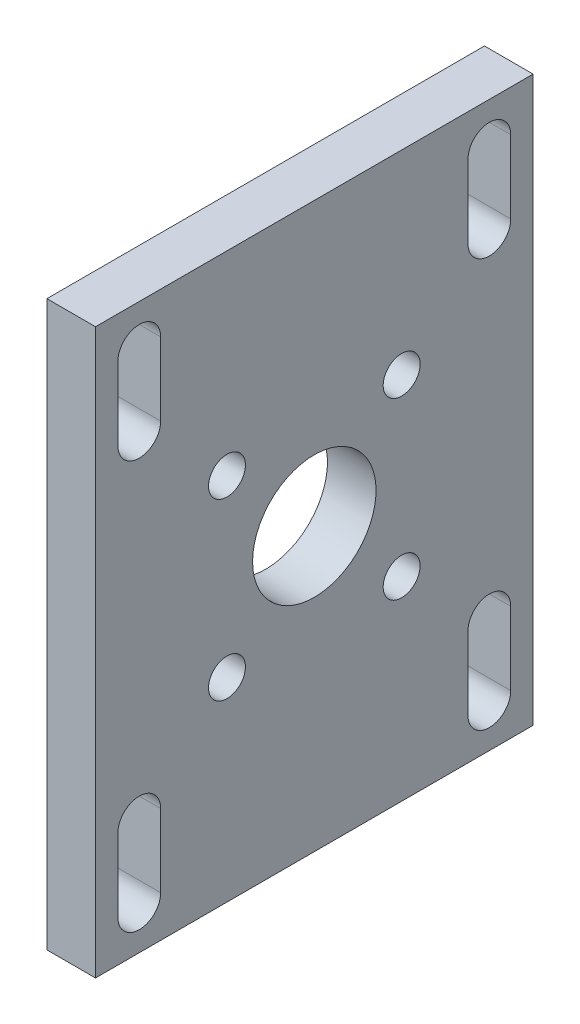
ISO-10303-21;
HEADER;
FILE_DESCRIPTION(('STEP AP214'),'2;1');
FILE_NAME('part.step','',(''),(''),'','','');
FILE_SCHEMA(('AUTOMOTIVE_DESIGN { 1 0 10303 214 1 1 1 1 }'));
ENDSEC;
DATA;
#1=APPLICATION_CONTEXT('core data for automotive mechanical design processes');
#2=APPLICATION_PROTOCOL_DEFINITION('international standard','automotive_design',2000,#1);
#3=PRODUCT_CONTEXT('',#1,'mechanical');
#4=PRODUCT('Part','Part','',(#3));
#5=PRODUCT_RELATED_PRODUCT_CATEGORY('part','',(#4));
#6=PRODUCT_DEFINITION_FORMATION('','',#4);
#7=PRODUCT_DEFINITION_CONTEXT('part definition',#1,'design');
#8=PRODUCT_DEFINITION('design','',#6,#7);
#9=PRODUCT_DEFINITION_SHAPE('','',#8);
#10=(LENGTH_UNIT() NAMED_UNIT(*) SI_UNIT(.MILLI.,.METRE.));
#11=(NAMED_UNIT(*) PLANE_ANGLE_UNIT() SI_UNIT($,.RADIAN.));
#12=(NAMED_UNIT(*) SI_UNIT($,.STERADIAN.) SOLID_ANGLE_UNIT());
#13=UNCERTAINTY_MEASURE_WITH_UNIT(LENGTH_MEASURE(1.E-05),#10,'distance_accuracy_value','');
#14=(GEOMETRIC_REPRESENTATION_CONTEXT(3) GLOBAL_UNCERTAINTY_ASSIGNED_CONTEXT((#13)) GLOBAL_UNIT_ASSIGNED_CONTEXT((#10,
#11,#12)) REPRESENTATION_CONTEXT('',''));
#15=CARTESIAN_POINT('',(0.,0.,0.));
#16=DIRECTION('',(0.,0.,1.));
#17=DIRECTION('',(1.,0.,0.));
#18=AXIS2_PLACEMENT_3D('',#15,#16,#17);
#19=CARTESIAN_POINT('',(5.,-29.,-22.5));
#20=DIRECTION('',(0.,0.,1.));
#21=DIRECTION('',(1.,0.,0.));
#22=AXIS2_PLACEMENT_3D('',#19,#20,#21);
#23=PLANE('',#22);
#24=DIRECTION('',(0.,1.,0.));
#25=VECTOR('',#24,1.);
#26=CARTESIAN_POINT('',(0.,-29.,-22.5));
#27=LINE('',#26,#25);
#28=CARTESIAN_POINT('',(0.,-29.,-22.5));
#29=VERTEX_POINT('',#28);
#30=CARTESIAN_POINT('',(0.,29.,-22.5));
#31=VERTEX_POINT('',#30);
#32=EDGE_CURVE('E298',#29,#31,#27,.T.);
#33=ORIENTED_EDGE('',*,*,#32,.T.);
#34=DIRECTION('',(-1.,0.,0.));
#35=VECTOR('',#34,1.);
#36=CARTESIAN_POINT('',(5.,29.,-22.5));
#37=LINE('',#36,#35);
#38=CARTESIAN_POINT('',(5.,29.,-22.5));
#39=VERTEX_POINT('',#38);
#40=EDGE_CURVE('E327',#39,#31,#37,.T.);
#41=ORIENTED_EDGE('',*,*,#40,.F.);
#42=DIRECTION('',(0.,1.,0.));
#43=VECTOR('',#42,1.);
#44=CARTESIAN_POINT('',(5.,-29.,-22.5));
#45=LINE('',#44,#43);
#46=CARTESIAN_POINT('',(5.,-29.,-22.5));
#47=VERTEX_POINT('',#46);
#48=EDGE_CURVE('E301',#47,#39,#45,.T.);
#49=ORIENTED_EDGE('',*,*,#48,.F.);
#50=DIRECTION('',(-1.,0.,0.));
#51=VECTOR('',#50,1.);
#52=CARTESIAN_POINT('',(5.,-29.,-22.5));
#53=LINE('',#52,#51);
#54=EDGE_CURVE('E311',#47,#29,#53,.T.);
#55=ORIENTED_EDGE('',*,*,#54,.T.);
#56=EDGE_LOOP('',(#33,#41,#49,#55));
#57=FACE_BOUND('',#56,.T.);
#58=ADVANCED_FACE('F46',(#57),#23,.F.);
#59=CARTESIAN_POINT('',(5.,29.,22.5));
#60=DIRECTION('',(0.,-1.,0.));
#61=DIRECTION('',(0.,0.,-1.));
#62=AXIS2_PLACEMENT_3D('',#59,#60,#61);
#63=PLANE('',#62);
#64=DIRECTION('',(0.,0.,1.));
#65=VECTOR('',#64,1.);
#66=CARTESIAN_POINT('',(0.,29.,22.5));
#67=LINE('',#66,#65);
#68=CARTESIAN_POINT('',(0.,29.,22.5));
#69=VERTEX_POINT('',#68);
#70=EDGE_CURVE('E314',#31,#69,#67,.T.);
#71=ORIENTED_EDGE('',*,*,#70,.T.);
#72=DIRECTION('',(-1.,0.,0.));
#73=VECTOR('',#72,1.);
#74=CARTESIAN_POINT('',(5.,29.,22.5));
#75=LINE('',#74,#73);
#76=CARTESIAN_POINT('',(5.,29.,22.5));
#77=VERTEX_POINT('',#76);
#78=EDGE_CURVE('E324',#77,#69,#75,.T.);
#79=ORIENTED_EDGE('',*,*,#78,.F.);
#80=DIRECTION('',(0.,0.,1.));
#81=VECTOR('',#80,1.);
#82=CARTESIAN_POINT('',(5.,29.,22.5));
#83=LINE('',#82,#81);
#84=EDGE_CURVE('E304',#39,#77,#83,.T.);
#85=ORIENTED_EDGE('',*,*,#84,.F.);
#86=ORIENTED_EDGE('',*,*,#40,.T.);
#87=EDGE_LOOP('',(#71,#79,#85,#86));
#88=FACE_BOUND('',#87,.T.);
#89=ADVANCED_FACE('F404',(#88),#63,.F.);
#90=CARTESIAN_POINT('',(5.,-29.,22.5));
#91=DIRECTION('',(0.,0.,-1.));
#92=DIRECTION('',(-1.,0.,0.));
#93=AXIS2_PLACEMENT_3D('',#90,#91,#92);
#94=PLANE('',#93);
#95=DIRECTION('',(0.,-1.,0.));
#96=VECTOR('',#95,1.);
#97=CARTESIAN_POINT('',(0.,-29.,22.5));
#98=LINE('',#97,#96);
#99=CARTESIAN_POINT('',(0.,-29.,22.5));
#100=VERTEX_POINT('',#99);
#101=EDGE_CURVE('E316',#69,#100,#98,.T.);
#102=ORIENTED_EDGE('',*,*,#101,.T.);
#103=DIRECTION('',(-1.,0.,0.));
#104=VECTOR('',#103,1.);
#105=CARTESIAN_POINT('',(5.,-29.,22.5));
#106=LINE('',#105,#104);
#107=CARTESIAN_POINT('',(5.,-29.,22.5));
#108=VERTEX_POINT('',#107);
#109=EDGE_CURVE('E321',#108,#100,#106,.T.);
#110=ORIENTED_EDGE('',*,*,#109,.F.);
#111=DIRECTION('',(0.,-1.,0.));
#112=VECTOR('',#111,1.);
#113=CARTESIAN_POINT('',(5.,-29.,22.5));
#114=LINE('',#113,#112);
#115=EDGE_CURVE('E307',#77,#108,#114,.T.);
#116=ORIENTED_EDGE('',*,*,#115,.F.);
#117=ORIENTED_EDGE('',*,*,#78,.T.);
#118=EDGE_LOOP('',(#102,#110,#116,#117));
#119=FACE_BOUND('',#118,.T.);
#120=ADVANCED_FACE('F410',(#119),#94,.F.);
#121=CARTESIAN_POINT('',(5.,-29.,22.5));
#122=DIRECTION('',(0.,1.,0.));
#123=DIRECTION('',(0.,0.,1.));
#124=AXIS2_PLACEMENT_3D('',#121,#122,#123);
#125=PLANE('',#124);
#126=DIRECTION('',(0.,0.,-1.));
#127=VECTOR('',#126,1.);
#128=CARTESIAN_POINT('',(0.,-29.,22.5));
#129=LINE('',#128,#127);
#130=EDGE_CURVE('E305',#100,#29,#129,.T.);
#131=ORIENTED_EDGE('',*,*,#130,.T.);
#132=ORIENTED_EDGE('',*,*,#54,.F.);
#133=DIRECTION('',(0.,0.,-1.));
#134=VECTOR('',#133,1.);
#135=CARTESIAN_POINT('',(5.,-29.,22.5));
#136=LINE('',#135,#134);
#137=EDGE_CURVE('E309',#108,#47,#136,.T.);
#138=ORIENTED_EDGE('',*,*,#137,.F.);
#139=ORIENTED_EDGE('',*,*,#109,.T.);
#140=EDGE_LOOP('',(#131,#132,#138,#139));
#141=FACE_BOUND('',#140,.T.);
#142=ADVANCED_FACE('F454',(#141),#125,.F.);
#143=CARTESIAN_POINT('',(5.,0.,0.));
#144=DIRECTION('',(-1.,0.,0.));
#145=DIRECTION('',(0.,0.,1.));
#146=AXIS2_PLACEMENT_3D('',#143,#144,#145);
#147=PLANE('',#146);
#148=DIRECTION('',(0.,-1.,0.));
#149=VECTOR('',#148,1.);
#150=CARTESIAN_POINT('',(5.,-24.75,15.8));
#151=LINE('',#150,#149);
#152=CARTESIAN_POINT('',(5.,-17.25,15.8));
#153=VERTEX_POINT('',#152);
#154=CARTESIAN_POINT('',(5.,-24.75,15.8));
#155=VERTEX_POINT('',#154);
#156=EDGE_CURVE('E218',#153,#155,#151,.T.);
#157=ORIENTED_EDGE('',*,*,#156,.T.);
#158=CARTESIAN_POINT('',(5.,-24.75,18.));
#159=DIRECTION('',(-1.,0.,0.));
#160=DIRECTION('',(0.,0.,1.));
#161=AXIS2_PLACEMENT_3D('',#158,#159,#160);
#162=CIRCLE('',#161,2.2);
#163=CARTESIAN_POINT('',(5.,-24.75,20.2));
#164=VERTEX_POINT('',#163);
#165=EDGE_CURVE('E223',#155,#164,#162,.T.);
#166=ORIENTED_EDGE('',*,*,#165,.T.);
#167=DIRECTION('',(0.,1.,0.));
#168=VECTOR('',#167,1.);
#169=CARTESIAN_POINT('',(5.,-24.75,20.2));
#170=LINE('',#169,#168);
#171=CARTESIAN_POINT('',(5.,-17.25,20.2));
#172=VERTEX_POINT('',#171);
#173=EDGE_CURVE('E195',#164,#172,#170,.T.);
#174=ORIENTED_EDGE('',*,*,#173,.T.);
#175=CARTESIAN_POINT('',(5.,-17.25,18.));
#176=DIRECTION('',(-1.,0.,0.));
#177=DIRECTION('',(0.,0.,1.));
#178=AXIS2_PLACEMENT_3D('',#175,#176,#177);
#179=CIRCLE('',#178,2.2);
#180=EDGE_CURVE('E202',#172,#153,#179,.T.);
#181=ORIENTED_EDGE('',*,*,#180,.T.);
#182=EDGE_LOOP('',(#157,#166,#174,#181));
#183=FACE_BOUND('',#182,.T.);
#184=DIRECTION('',(0.,-1.,0.));
#185=VECTOR('',#184,1.);
#186=CARTESIAN_POINT('',(5.,-24.75,-20.2));
#187=LINE('',#186,#185);
#188=CARTESIAN_POINT('',(5.,-17.25,-20.2));
#189=VERTEX_POINT('',#188);
#190=CARTESIAN_POINT('',(5.,-24.75,-20.2));
#191=VERTEX_POINT('',#190);
#192=EDGE_CURVE('E237',#189,#191,#187,.T.);
#193=ORIENTED_EDGE('',*,*,#192,.T.);
#194=CARTESIAN_POINT('',(5.,-24.75,-18.));
#195=DIRECTION('',(-1.,0.,0.));
#196=DIRECTION('',(0.,0.,1.));
#197=AXIS2_PLACEMENT_3D('',#194,#195,#196);
#198=CIRCLE('',#197,2.2);
#199=CARTESIAN_POINT('',(5.,-24.75,-15.8));
#200=VERTEX_POINT('',#199);
#201=EDGE_CURVE('E227',#191,#200,#198,.T.);
#202=ORIENTED_EDGE('',*,*,#201,.T.);
#203=DIRECTION('',(0.,1.,0.));
#204=VECTOR('',#203,1.);
#205=CARTESIAN_POINT('',(5.,-24.75,-15.8));
#206=LINE('',#205,#204);
#207=CARTESIAN_POINT('',(5.,-17.25,-15.8));
#208=VERTEX_POINT('',#207);
#209=EDGE_CURVE('E230',#200,#208,#206,.T.);
#210=ORIENTED_EDGE('',*,*,#209,.T.);
#211=CARTESIAN_POINT('',(5.,-17.25,-18.));
#212=DIRECTION('',(-1.,0.,0.));
#213=DIRECTION('',(0.,0.,1.));
#214=AXIS2_PLACEMENT_3D('',#211,#212,#213);
#215=CIRCLE('',#214,2.2);
#216=EDGE_CURVE('E234',#208,#189,#215,.T.);
#217=ORIENTED_EDGE('',*,*,#216,.T.);
#218=EDGE_LOOP('',(#193,#202,#210,#217));
#219=FACE_BOUND('',#218,.T.);
#220=CARTESIAN_POINT('',(5.,8.98025612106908,-8.98025612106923));
#221=DIRECTION('',(-1.,0.,0.));
#222=DIRECTION('',(0.,0.,1.));
#223=AXIS2_PLACEMENT_3D('',#220,#221,#222);
#224=CIRCLE('',#223,1.89865);
#225=CARTESIAN_POINT('',(5.,8.98025612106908,-7.08160612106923));
#226=VERTEX_POINT('',#225);
#227=EDGE_CURVE('E264',#226,#226,#224,.T.);
#228=ORIENTED_EDGE('',*,*,#227,.T.);
#229=EDGE_LOOP('',(#228));
#230=FACE_BOUND('',#229,.T.);
#231=CARTESIAN_POINT('',(5.,8.98025612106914,8.98025612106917));
#232=DIRECTION('',(-1.,0.,0.));
#233=DIRECTION('',(0.,0.,1.));
#234=AXIS2_PLACEMENT_3D('',#231,#232,#233);
#235=CIRCLE('',#234,1.89865);
#236=CARTESIAN_POINT('',(5.,8.98025612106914,10.8789061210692));
#237=VERTEX_POINT('',#236);
#238=EDGE_CURVE('E273',#237,#237,#235,.T.);
#239=ORIENTED_EDGE('',*,*,#238,.T.);
#240=EDGE_LOOP('',(#239));
#241=FACE_BOUND('',#240,.T.);
#242=CARTESIAN_POINT('',(5.,-8.98025612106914,8.98025612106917));
#243=DIRECTION('',(-1.,0.,0.));
#244=DIRECTION('',(0.,0.,1.));
#245=AXIS2_PLACEMENT_3D('',#242,#243,#244);
#246=CIRCLE('',#245,1.89865);
#247=CARTESIAN_POINT('',(5.,-8.98025612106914,10.8789061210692));
#248=VERTEX_POINT('',#247);
#249=EDGE_CURVE('E282',#248,#248,#246,.T.);
#250=ORIENTED_EDGE('',*,*,#249,.T.);
#251=EDGE_LOOP('',(#250));
#252=FACE_BOUND('',#251,.T.);
#253=CARTESIAN_POINT('',(5.,-8.98025612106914,-8.98025612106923));
#254=DIRECTION('',(-1.,0.,0.));
#255=DIRECTION('',(0.,0.,1.));
#256=AXIS2_PLACEMENT_3D('',#253,#254,#255);
#257=CIRCLE('',#256,1.89865);
#258=CARTESIAN_POINT('',(5.,-8.98025612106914,-7.08160612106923));
#259=VERTEX_POINT('',#258);
#260=EDGE_CURVE('E291',#259,#259,#257,.T.);
#261=ORIENTED_EDGE('',*,*,#260,.T.);
#262=EDGE_LOOP('',(#261));
#263=FACE_BOUND('',#262,.T.);
#264=CARTESIAN_POINT('',(5.,0.,0.));
#265=DIRECTION('',(-1.,0.,0.));
#266=DIRECTION('',(0.,0.,1.));
#267=AXIS2_PLACEMENT_3D('',#264,#265,#266);
#268=CIRCLE('',#267,6.35);
#269=CARTESIAN_POINT('',(5.,0.,6.35));
#270=VERTEX_POINT('',#269);
#271=EDGE_CURVE('E295',#270,#270,#268,.T.);
#272=ORIENTED_EDGE('',*,*,#271,.T.);
#273=EDGE_LOOP('',(#272));
#274=FACE_BOUND('',#273,.T.);
#275=ORIENTED_EDGE('',*,*,#48,.T.);
#276=ORIENTED_EDGE('',*,*,#84,.T.);
#277=ORIENTED_EDGE('',*,*,#115,.T.);
#278=ORIENTED_EDGE('',*,*,#137,.T.);
#279=EDGE_LOOP('',(#275,#276,#277,#278));
#280=FACE_BOUND('',#279,.T.);
#281=CARTESIAN_POINT('',(5.,17.25,-18.));
#282=DIRECTION('',(-1.,0.,0.));
#283=DIRECTION('',(0.,0.,1.));
#284=AXIS2_PLACEMENT_3D('',#281,#282,#283);
#285=CIRCLE('',#284,2.2);
#286=CARTESIAN_POINT('',(5.,17.25,-20.2));
#287=VERTEX_POINT('',#286);
#288=CARTESIAN_POINT('',(5.,17.25,-15.8));
#289=VERTEX_POINT('',#288);
#290=EDGE_CURVE('E341',#287,#289,#285,.T.);
#291=ORIENTED_EDGE('',*,*,#290,.T.);
#292=DIRECTION('',(0.,1.,0.));
#293=VECTOR('',#292,1.);
#294=CARTESIAN_POINT('',(5.,17.25,-15.8));
#295=LINE('',#294,#293);
#296=CARTESIAN_POINT('',(5.,24.75,-15.8));
#297=VERTEX_POINT('',#296);
#298=EDGE_CURVE('E343',#289,#297,#295,.T.);
#299=ORIENTED_EDGE('',*,*,#298,.T.);
#300=CARTESIAN_POINT('',(5.,24.75,-18.));
#301=DIRECTION('',(-1.,0.,0.));
#302=DIRECTION('',(0.,0.,1.));
#303=AXIS2_PLACEMENT_3D('',#300,#301,#302);
#304=CIRCLE('',#303,2.2);
#305=CARTESIAN_POINT('',(5.,24.75,-20.2));
#306=VERTEX_POINT('',#305);
#307=EDGE_CURVE('E345',#297,#306,#304,.T.);
#308=ORIENTED_EDGE('',*,*,#307,.T.);
#309=DIRECTION('',(0.,-1.,0.));
#310=VECTOR('',#309,1.);
#311=CARTESIAN_POINT('',(5.,17.25,-20.2));
#312=LINE('',#311,#310);
#313=EDGE_CURVE('E347',#306,#287,#312,.T.);
#314=ORIENTED_EDGE('',*,*,#313,.T.);
#315=EDGE_LOOP('',(#291,#299,#308,#314));
#316=FACE_BOUND('',#315,.T.);
#317=CARTESIAN_POINT('',(5.,17.25,18.));
#318=DIRECTION('',(-1.,0.,0.));
#319=DIRECTION('',(0.,0.,1.));
#320=AXIS2_PLACEMENT_3D('',#317,#318,#319);
#321=CIRCLE('',#320,2.2);
#322=CARTESIAN_POINT('',(5.,17.25,15.8));
#323=VERTEX_POINT('',#322);
#324=CARTESIAN_POINT('',(5.,17.25,20.2));
#325=VERTEX_POINT('',#324);
#326=EDGE_CURVE('E61',#323,#325,#321,.T.);
#327=ORIENTED_EDGE('',*,*,#326,.T.);
#328=DIRECTION('',(0.,1.,0.));
#329=VECTOR('',#328,1.);
#330=CARTESIAN_POINT('',(5.,17.25,20.2));
#331=LINE('',#330,#329);
#332=CARTESIAN_POINT('',(5.,24.75,20.2));
#333=VERTEX_POINT('',#332);
#334=EDGE_CURVE('E374',#325,#333,#331,.T.);
#335=ORIENTED_EDGE('',*,*,#334,.T.);
#336=CARTESIAN_POINT('',(5.,24.75,18.));
#337=DIRECTION('',(-1.,0.,0.));
#338=DIRECTION('',(0.,0.,1.));
#339=AXIS2_PLACEMENT_3D('',#336,#337,#338);
#340=CIRCLE('',#339,2.2);
#341=CARTESIAN_POINT('',(5.,24.75,15.8));
#342=VERTEX_POINT('',#341);
#343=EDGE_CURVE('E68',#333,#342,#340,.T.);
#344=ORIENTED_EDGE('',*,*,#343,.T.);
#345=DIRECTION('',(0.,-1.,0.));
#346=VECTOR('',#345,1.);
#347=CARTESIAN_POINT('',(5.,17.25,15.8));
#348=LINE('',#347,#346);
#349=EDGE_CURVE('E377',#342,#323,#348,.T.);
#350=ORIENTED_EDGE('',*,*,#349,.T.);
#351=EDGE_LOOP('',(#327,#335,#344,#350));
#352=FACE_BOUND('',#351,.T.);
#353=ADVANCED_FACE('F442',(#183,#219,#230,#241,#252,#263,#274,#280,#316,#352),#147,.F.);
#354=CARTESIAN_POINT('',(0.,0.,0.));
#355=DIRECTION('',(-1.,0.,0.));
#356=DIRECTION('',(0.,0.,1.));
#357=AXIS2_PLACEMENT_3D('',#354,#355,#356);
#358=PLANE('',#357);
#359=CARTESIAN_POINT('',(0.,-24.75,18.));
#360=DIRECTION('',(-1.,0.,0.));
#361=DIRECTION('',(0.,0.,1.));
#362=AXIS2_PLACEMENT_3D('',#359,#360,#361);
#363=CIRCLE('',#362,2.2);
#364=CARTESIAN_POINT('',(0.,-24.75,15.8));
#365=VERTEX_POINT('',#364);
#366=CARTESIAN_POINT('',(0.,-24.75,20.2));
#367=VERTEX_POINT('',#366);
#368=EDGE_CURVE('E221',#365,#367,#363,.T.);
#369=ORIENTED_EDGE('',*,*,#368,.F.);
#370=DIRECTION('',(0.,-1.,0.));
#371=VECTOR('',#370,1.);
#372=CARTESIAN_POINT('',(0.,-24.75,15.8));
#373=LINE('',#372,#371);
#374=CARTESIAN_POINT('',(0.,-17.25,15.8));
#375=VERTEX_POINT('',#374);
#376=EDGE_CURVE('E207',#375,#365,#373,.T.);
#377=ORIENTED_EDGE('',*,*,#376,.F.);
#378=CARTESIAN_POINT('',(0.,-17.25,18.));
#379=DIRECTION('',(-1.,0.,0.));
#380=DIRECTION('',(0.,0.,1.));
#381=AXIS2_PLACEMENT_3D('',#378,#379,#380);
#382=CIRCLE('',#381,2.2);
#383=CARTESIAN_POINT('',(0.,-17.25,20.2));
#384=VERTEX_POINT('',#383);
#385=EDGE_CURVE('E199',#384,#375,#382,.T.);
#386=ORIENTED_EDGE('',*,*,#385,.F.);
#387=DIRECTION('',(0.,1.,0.));
#388=VECTOR('',#387,1.);
#389=CARTESIAN_POINT('',(0.,-24.75,20.2));
#390=LINE('',#389,#388);
#391=EDGE_CURVE('E185',#367,#384,#390,.T.);
#392=ORIENTED_EDGE('',*,*,#391,.F.);
#393=EDGE_LOOP('',(#369,#377,#386,#392));
#394=FACE_BOUND('',#393,.T.);
#395=CARTESIAN_POINT('',(0.,-24.75,-18.));
#396=DIRECTION('',(-1.,0.,0.));
#397=DIRECTION('',(0.,0.,1.));
#398=AXIS2_PLACEMENT_3D('',#395,#396,#397);
#399=CIRCLE('',#398,2.2);
#400=CARTESIAN_POINT('',(0.,-24.75,-20.2));
#401=VERTEX_POINT('',#400);
#402=CARTESIAN_POINT('',(0.,-24.75,-15.8));
#403=VERTEX_POINT('',#402);
#404=EDGE_CURVE('E226',#401,#403,#399,.T.);
#405=ORIENTED_EDGE('',*,*,#404,.F.);
#406=DIRECTION('',(0.,-1.,0.));
#407=VECTOR('',#406,1.);
#408=CARTESIAN_POINT('',(0.,-24.75,-20.2));
#409=LINE('',#408,#407);
#410=CARTESIAN_POINT('',(0.,-17.25,-20.2));
#411=VERTEX_POINT('',#410);
#412=EDGE_CURVE('E231',#411,#401,#409,.T.);
#413=ORIENTED_EDGE('',*,*,#412,.F.);
#414=CARTESIAN_POINT('',(0.,-17.25,-18.));
#415=DIRECTION('',(-1.,0.,0.));
#416=DIRECTION('',(0.,0.,1.));
#417=AXIS2_PLACEMENT_3D('',#414,#415,#416);
#418=CIRCLE('',#417,2.2);
#419=CARTESIAN_POINT('',(0.,-17.25,-15.8));
#420=VERTEX_POINT('',#419);
#421=EDGE_CURVE('E245',#420,#411,#418,.T.);
#422=ORIENTED_EDGE('',*,*,#421,.F.);
#423=DIRECTION('',(0.,1.,0.));
#424=VECTOR('',#423,1.);
#425=CARTESIAN_POINT('',(0.,-24.75,-15.8));
#426=LINE('',#425,#424);
#427=EDGE_CURVE('E242',#403,#420,#426,.T.);
#428=ORIENTED_EDGE('',*,*,#427,.F.);
#429=EDGE_LOOP('',(#405,#413,#422,#428));
#430=FACE_BOUND('',#429,.T.);
#431=CARTESIAN_POINT('',(0.,8.98025612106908,-8.98025612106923));
#432=DIRECTION('',(-1.,0.,0.));
#433=DIRECTION('',(0.,0.,1.));
#434=AXIS2_PLACEMENT_3D('',#431,#432,#433);
#435=CIRCLE('',#434,3.5433);
#436=CARTESIAN_POINT('',(0.,8.98025612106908,-5.43695612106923));
#437=VERTEX_POINT('',#436);
#438=EDGE_CURVE('E252',#437,#437,#435,.T.);
#439=ORIENTED_EDGE('',*,*,#438,.F.);
#440=EDGE_LOOP('',(#439));
#441=FACE_BOUND('',#440,.T.);
#442=CARTESIAN_POINT('',(0.,8.98025612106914,8.98025612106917));
#443=DIRECTION('',(-1.,0.,0.));
#444=DIRECTION('',(0.,0.,1.));
#445=AXIS2_PLACEMENT_3D('',#442,#443,#444);
#446=CIRCLE('',#445,3.5433);
#447=CARTESIAN_POINT('',(0.,8.98025612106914,12.5235561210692));
#448=VERTEX_POINT('',#447);
#449=EDGE_CURVE('E267',#448,#448,#446,.T.);
#450=ORIENTED_EDGE('',*,*,#449,.F.);
#451=EDGE_LOOP('',(#450));
#452=FACE_BOUND('',#451,.T.);
#453=CARTESIAN_POINT('',(0.,-8.98025612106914,8.98025612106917));
#454=DIRECTION('',(-1.,0.,0.));
#455=DIRECTION('',(0.,0.,1.));
#456=AXIS2_PLACEMENT_3D('',#453,#454,#455);
#457=CIRCLE('',#456,3.5433);
#458=CARTESIAN_POINT('',(0.,-8.98025612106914,12.5235561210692));
#459=VERTEX_POINT('',#458);
#460=EDGE_CURVE('E276',#459,#459,#457,.T.);
#461=ORIENTED_EDGE('',*,*,#460,.F.);
#462=EDGE_LOOP('',(#461));
#463=FACE_BOUND('',#462,.T.);
#464=CARTESIAN_POINT('',(0.,-8.98025612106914,-8.98025612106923));
#465=DIRECTION('',(-1.,0.,0.));
#466=DIRECTION('',(0.,0.,1.));
#467=AXIS2_PLACEMENT_3D('',#464,#465,#466);
#468=CIRCLE('',#467,3.5433);
#469=CARTESIAN_POINT('',(0.,-8.98025612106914,-5.43695612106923));
#470=VERTEX_POINT('',#469);
#471=EDGE_CURVE('E285',#470,#470,#468,.T.);
#472=ORIENTED_EDGE('',*,*,#471,.F.);
#473=EDGE_LOOP('',(#472));
#474=FACE_BOUND('',#473,.T.);
#475=CARTESIAN_POINT('',(0.,0.,0.));
#476=DIRECTION('',(-1.,0.,0.));
#477=DIRECTION('',(0.,0.,1.));
#478=AXIS2_PLACEMENT_3D('',#475,#476,#477);
#479=CIRCLE('',#478,6.35);
#480=CARTESIAN_POINT('',(0.,0.,6.35));
#481=VERTEX_POINT('',#480);
#482=EDGE_CURVE('E294',#481,#481,#479,.T.);
#483=ORIENTED_EDGE('',*,*,#482,.F.);
#484=EDGE_LOOP('',(#483));
#485=FACE_BOUND('',#484,.T.);
#486=ORIENTED_EDGE('',*,*,#32,.F.);
#487=ORIENTED_EDGE('',*,*,#130,.F.);
#488=ORIENTED_EDGE('',*,*,#101,.F.);
#489=ORIENTED_EDGE('',*,*,#70,.F.);
#490=EDGE_LOOP('',(#486,#487,#488,#489));
#491=FACE_BOUND('',#490,.T.);
#492=CARTESIAN_POINT('',(0.,17.25,-18.));
#493=DIRECTION('',(-1.,0.,0.));
#494=DIRECTION('',(0.,0.,1.));
#495=AXIS2_PLACEMENT_3D('',#492,#493,#494);
#496=CIRCLE('',#495,2.2);
#497=CARTESIAN_POINT('',(0.,17.25,-20.2));
#498=VERTEX_POINT('',#497);
#499=CARTESIAN_POINT('',(0.,17.25,-15.8));
#500=VERTEX_POINT('',#499);
#501=EDGE_CURVE('E330',#498,#500,#496,.T.);
#502=ORIENTED_EDGE('',*,*,#501,.F.);
#503=DIRECTION('',(0.,-1.,0.));
#504=VECTOR('',#503,1.);
#505=CARTESIAN_POINT('',(0.,17.25,-20.2));
#506=LINE('',#505,#504);
#507=CARTESIAN_POINT('',(0.,24.75,-20.2));
#508=VERTEX_POINT('',#507);
#509=EDGE_CURVE('E332',#508,#498,#506,.T.);
#510=ORIENTED_EDGE('',*,*,#509,.F.);
#511=CARTESIAN_POINT('',(0.,24.75,-18.));
#512=DIRECTION('',(-1.,0.,0.));
#513=DIRECTION('',(0.,0.,1.));
#514=AXIS2_PLACEMENT_3D('',#511,#512,#513);
#515=CIRCLE('',#514,2.2);
#516=CARTESIAN_POINT('',(0.,24.75,-15.8));
#517=VERTEX_POINT('',#516);
#518=EDGE_CURVE('E335',#517,#508,#515,.T.);
#519=ORIENTED_EDGE('',*,*,#518,.F.);
#520=DIRECTION('',(0.,1.,0.));
#521=VECTOR('',#520,1.);
#522=CARTESIAN_POINT('',(0.,17.25,-15.8));
#523=LINE('',#522,#521);
#524=EDGE_CURVE('E338',#500,#517,#523,.T.);
#525=ORIENTED_EDGE('',*,*,#524,.F.);
#526=EDGE_LOOP('',(#502,#510,#519,#525));
#527=FACE_BOUND('',#526,.T.);
#528=CARTESIAN_POINT('',(0.,17.25,18.));
#529=DIRECTION('',(-1.,0.,0.));
#530=DIRECTION('',(0.,0.,1.));
#531=AXIS2_PLACEMENT_3D('',#528,#529,#530);
#532=CIRCLE('',#531,2.2);
#533=CARTESIAN_POINT('',(0.,17.25,15.8));
#534=VERTEX_POINT('',#533);
#535=CARTESIAN_POINT('',(0.,17.25,20.2));
#536=VERTEX_POINT('',#535);
#537=EDGE_CURVE('E362',#534,#536,#532,.T.);
#538=ORIENTED_EDGE('',*,*,#537,.F.);
#539=DIRECTION('',(0.,-1.,0.));
#540=VECTOR('',#539,1.);
#541=CARTESIAN_POINT('',(0.,17.25,15.8));
#542=LINE('',#541,#540);
#543=CARTESIAN_POINT('',(0.,24.75,15.8));
#544=VERTEX_POINT('',#543);
#545=EDGE_CURVE('E364',#544,#534,#542,.T.);
#546=ORIENTED_EDGE('',*,*,#545,.F.);
#547=CARTESIAN_POINT('',(0.,24.75,18.));
#548=DIRECTION('',(-1.,0.,0.));
#549=DIRECTION('',(0.,0.,1.));
#550=AXIS2_PLACEMENT_3D('',#547,#548,#549);
#551=CIRCLE('',#550,2.2);
#552=CARTESIAN_POINT('',(0.,24.75,20.2));
#553=VERTEX_POINT('',#552);
#554=EDGE_CURVE('E367',#553,#544,#551,.T.);
#555=ORIENTED_EDGE('',*,*,#554,.F.);
#556=DIRECTION('',(0.,1.,0.));
#557=VECTOR('',#556,1.);
#558=CARTESIAN_POINT('',(0.,17.25,20.2));
#559=LINE('',#558,#557);
#560=EDGE_CURVE('E370',#536,#553,#559,.T.);
#561=ORIENTED_EDGE('',*,*,#560,.F.);
#562=EDGE_LOOP('',(#538,#546,#555,#561));
#563=FACE_BOUND('',#562,.T.);
#564=ADVANCED_FACE('F205',(#394,#430,#441,#452,#463,#474,#485,#491,#527,#563),#358,.T.);
#565=CARTESIAN_POINT('',(5.,0.,0.));
#566=DIRECTION('',(-1.,0.,0.));
#567=DIRECTION('',(0.,0.,1.));
#568=AXIS2_PLACEMENT_3D('',#565,#566,#567);
#569=CYLINDRICAL_SURFACE('',#568,6.35);
#570=ORIENTED_EDGE('',*,*,#271,.F.);
#571=EDGE_LOOP('',(#570));
#572=FACE_BOUND('',#571,.T.);
#573=ORIENTED_EDGE('',*,*,#482,.T.);
#574=EDGE_LOOP('',(#573));
#575=FACE_BOUND('',#574,.T.);
#576=ADVANCED_FACE('F445',(#572,#575),#569,.F.);
#577=CARTESIAN_POINT('',(0.,-8.98025612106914,-8.98025612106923));
#578=DIRECTION('',(-1.,0.,0.));
#579=DIRECTION('',(0.,0.,1.));
#580=AXIS2_PLACEMENT_3D('',#577,#578,#579);
#581=CYLINDRICAL_SURFACE('',#580,1.89865);
#582=ORIENTED_EDGE('',*,*,#260,.F.);
#583=EDGE_LOOP('',(#582));
#584=FACE_BOUND('',#583,.T.);
#585=CARTESIAN_POINT('',(1.89195340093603,-8.98025612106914,-8.98025612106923));
#586=DIRECTION('',(-1.,0.,0.));
#587=DIRECTION('',(0.,0.,1.));
#588=AXIS2_PLACEMENT_3D('',#585,#586,#587);
#589=CIRCLE('',#588,1.89865);
#590=CARTESIAN_POINT('',(1.89195340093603,-8.98025612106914,-7.08160612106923));
#591=VERTEX_POINT('',#590);
#592=EDGE_CURVE('E288',#591,#591,#589,.T.);
#593=ORIENTED_EDGE('',*,*,#592,.T.);
#594=EDGE_LOOP('',(#593));
#595=FACE_BOUND('',#594,.T.);
#596=ADVANCED_FACE('F451',(#584,#595),#581,.F.);
#597=CARTESIAN_POINT('',(0.,-8.98025612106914,-8.98025612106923));
#598=DIRECTION('',(-1.,0.,0.));
#599=DIRECTION('',(0.,0.,1.));
#600=AXIS2_PLACEMENT_3D('',#597,#598,#599);
#601=CONICAL_SURFACE('',#600,3.5433,0.715584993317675);
#602=ORIENTED_EDGE('',*,*,#592,.F.);
#603=EDGE_LOOP('',(#602));
#604=FACE_BOUND('',#603,.T.);
#605=ORIENTED_EDGE('',*,*,#471,.T.);
#606=EDGE_LOOP('',(#605));
#607=FACE_BOUND('',#606,.T.);
#608=ADVANCED_FACE('F620',(#604,#607),#601,.F.);
#609=CARTESIAN_POINT('',(0.,-8.98025612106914,8.98025612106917));
#610=DIRECTION('',(-1.,0.,0.));
#611=DIRECTION('',(0.,0.,1.));
#612=AXIS2_PLACEMENT_3D('',#609,#610,#611);
#613=CYLINDRICAL_SURFACE('',#612,1.89865);
#614=ORIENTED_EDGE('',*,*,#249,.F.);
#615=EDGE_LOOP('',(#614));
#616=FACE_BOUND('',#615,.T.);
#617=CARTESIAN_POINT('',(1.89195340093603,-8.98025612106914,8.98025612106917));
#618=DIRECTION('',(-1.,0.,0.));
#619=DIRECTION('',(0.,0.,1.));
#620=AXIS2_PLACEMENT_3D('',#617,#618,#619);
#621=CIRCLE('',#620,1.89865);
#622=CARTESIAN_POINT('',(1.89195340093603,-8.98025612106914,10.8789061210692));
#623=VERTEX_POINT('',#622);
#624=EDGE_CURVE('E279',#623,#623,#621,.T.);
#625=ORIENTED_EDGE('',*,*,#624,.T.);
#626=EDGE_LOOP('',(#625));
#627=FACE_BOUND('',#626,.T.);
#628=ADVANCED_FACE('F616',(#616,#627),#613,.F.);
#629=CARTESIAN_POINT('',(0.,-8.98025612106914,8.98025612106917));
#630=DIRECTION('',(-1.,0.,0.));
#631=DIRECTION('',(0.,0.,1.));
#632=AXIS2_PLACEMENT_3D('',#629,#630,#631);
#633=CONICAL_SURFACE('',#632,3.5433,0.715584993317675);
#634=ORIENTED_EDGE('',*,*,#624,.F.);
#635=EDGE_LOOP('',(#634));
#636=FACE_BOUND('',#635,.T.);
#637=ORIENTED_EDGE('',*,*,#460,.T.);
#638=EDGE_LOOP('',(#637));
#639=FACE_BOUND('',#638,.T.);
#640=ADVANCED_FACE('F612',(#636,#639),#633,.F.);
#641=CARTESIAN_POINT('',(0.,8.98025612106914,8.98025612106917));
#642=DIRECTION('',(-1.,0.,0.));
#643=DIRECTION('',(0.,0.,1.));
#644=AXIS2_PLACEMENT_3D('',#641,#642,#643);
#645=CYLINDRICAL_SURFACE('',#644,1.89865);
#646=ORIENTED_EDGE('',*,*,#238,.F.);
#647=EDGE_LOOP('',(#646));
#648=FACE_BOUND('',#647,.T.);
#649=CARTESIAN_POINT('',(1.89195340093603,8.98025612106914,8.98025612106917));
#650=DIRECTION('',(-1.,0.,0.));
#651=DIRECTION('',(0.,0.,1.));
#652=AXIS2_PLACEMENT_3D('',#649,#650,#651);
#653=CIRCLE('',#652,1.89865);
#654=CARTESIAN_POINT('',(1.89195340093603,8.98025612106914,10.8789061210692));
#655=VERTEX_POINT('',#654);
#656=EDGE_CURVE('E270',#655,#655,#653,.T.);
#657=ORIENTED_EDGE('',*,*,#656,.T.);
#658=EDGE_LOOP('',(#657));
#659=FACE_BOUND('',#658,.T.);
#660=ADVANCED_FACE('F608',(#648,#659),#645,.F.);
#661=CARTESIAN_POINT('',(0.,8.98025612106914,8.98025612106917));
#662=DIRECTION('',(-1.,0.,0.));
#663=DIRECTION('',(0.,0.,1.));
#664=AXIS2_PLACEMENT_3D('',#661,#662,#663);
#665=CONICAL_SURFACE('',#664,3.5433,0.715584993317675);
#666=ORIENTED_EDGE('',*,*,#656,.F.);
#667=EDGE_LOOP('',(#666));
#668=FACE_BOUND('',#667,.T.);
#669=ORIENTED_EDGE('',*,*,#449,.T.);
#670=EDGE_LOOP('',(#669));
#671=FACE_BOUND('',#670,.T.);
#672=ADVANCED_FACE('F604',(#668,#671),#665,.F.);
#673=CARTESIAN_POINT('',(0.,8.98025612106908,-8.98025612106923));
#674=DIRECTION('',(-1.,0.,0.));
#675=DIRECTION('',(0.,0.,1.));
#676=AXIS2_PLACEMENT_3D('',#673,#674,#675);
#677=CYLINDRICAL_SURFACE('',#676,1.89865);
#678=ORIENTED_EDGE('',*,*,#227,.F.);
#679=EDGE_LOOP('',(#678));
#680=FACE_BOUND('',#679,.T.);
#681=CARTESIAN_POINT('',(1.89195340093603,8.98025612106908,-8.98025612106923));
#682=DIRECTION('',(-1.,0.,0.));
#683=DIRECTION('',(0.,0.,1.));
#684=AXIS2_PLACEMENT_3D('',#681,#682,#683);
#685=CIRCLE('',#684,1.89865);
#686=CARTESIAN_POINT('',(1.89195340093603,8.98025612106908,-7.08160612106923));
#687=VERTEX_POINT('',#686);
#688=EDGE_CURVE('E261',#687,#687,#685,.T.);
#689=ORIENTED_EDGE('',*,*,#688,.T.);
#690=EDGE_LOOP('',(#689));
#691=FACE_BOUND('',#690,.T.);
#692=ADVANCED_FACE('F600',(#680,#691),#677,.F.);
#693=CARTESIAN_POINT('',(0.,8.98025612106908,-8.98025612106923));
#694=DIRECTION('',(-1.,0.,0.));
#695=DIRECTION('',(0.,0.,1.));
#696=AXIS2_PLACEMENT_3D('',#693,#694,#695);
#697=CONICAL_SURFACE('',#696,3.5433,0.715584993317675);
#698=ORIENTED_EDGE('',*,*,#688,.F.);
#699=EDGE_LOOP('',(#698));
#700=FACE_BOUND('',#699,.T.);
#701=ORIENTED_EDGE('',*,*,#438,.T.);
#702=EDGE_LOOP('',(#701));
#703=FACE_BOUND('',#702,.T.);
#704=ADVANCED_FACE('F596',(#700,#703),#697,.F.);
#705=CARTESIAN_POINT('',(5.,-24.75,-18.));
#706=DIRECTION('',(-1.,0.,0.));
#707=DIRECTION('',(0.,0.,1.));
#708=AXIS2_PLACEMENT_3D('',#705,#706,#707);
#709=CYLINDRICAL_SURFACE('',#708,2.2);
#710=ORIENTED_EDGE('',*,*,#404,.T.);
#711=DIRECTION('',(-1.,0.,0.));
#712=VECTOR('',#711,1.);
#713=CARTESIAN_POINT('',(5.,-24.75,-15.8));
#714=LINE('',#713,#712);
#715=EDGE_CURVE('E240',#200,#403,#714,.T.);
#716=ORIENTED_EDGE('',*,*,#715,.F.);
#717=ORIENTED_EDGE('',*,*,#201,.F.);
#718=DIRECTION('',(-1.,0.,0.));
#719=VECTOR('',#718,1.);
#720=CARTESIAN_POINT('',(5.,-24.75,-20.2));
#721=LINE('',#720,#719);
#722=EDGE_CURVE('E250',#191,#401,#721,.T.);
#723=ORIENTED_EDGE('',*,*,#722,.T.);
#724=EDGE_LOOP('',(#710,#716,#717,#723));
#725=FACE_BOUND('',#724,.T.);
#726=ADVANCED_FACE('F587',(#725),#709,.F.);
#727=CARTESIAN_POINT('',(5.,-24.75,-20.2));
#728=DIRECTION('',(0.,0.,-1.));
#729=DIRECTION('',(-1.,0.,0.));
#730=AXIS2_PLACEMENT_3D('',#727,#728,#729);
#731=PLANE('',#730);
#732=ORIENTED_EDGE('',*,*,#412,.T.);
#733=ORIENTED_EDGE('',*,*,#722,.F.);
#734=ORIENTED_EDGE('',*,*,#192,.F.);
#735=DIRECTION('',(-1.,0.,0.));
#736=VECTOR('',#735,1.);
#737=CARTESIAN_POINT('',(5.,-17.25,-20.2));
#738=LINE('',#737,#736);
#739=EDGE_CURVE('E253',#189,#411,#738,.T.);
#740=ORIENTED_EDGE('',*,*,#739,.T.);
#741=EDGE_LOOP('',(#732,#733,#734,#740));
#742=FACE_BOUND('',#741,.T.);
#743=ADVANCED_FACE('F583',(#742),#731,.F.);
#744=CARTESIAN_POINT('',(5.,-17.25,-18.));
#745=DIRECTION('',(-1.,0.,0.));
#746=DIRECTION('',(0.,0.,1.));
#747=AXIS2_PLACEMENT_3D('',#744,#745,#746);
#748=CYLINDRICAL_SURFACE('',#747,2.2);
#749=ORIENTED_EDGE('',*,*,#421,.T.);
#750=ORIENTED_EDGE('',*,*,#739,.F.);
#751=ORIENTED_EDGE('',*,*,#216,.F.);
#752=DIRECTION('',(-1.,0.,0.));
#753=VECTOR('',#752,1.);
#754=CARTESIAN_POINT('',(5.,-17.25,-15.8));
#755=LINE('',#754,#753);
#756=EDGE_CURVE('E255',#208,#420,#755,.T.);
#757=ORIENTED_EDGE('',*,*,#756,.T.);
#758=EDGE_LOOP('',(#749,#750,#751,#757));
#759=FACE_BOUND('',#758,.T.);
#760=ADVANCED_FACE('F586',(#759),#748,.F.);
#761=CARTESIAN_POINT('',(5.,-24.75,-15.8));
#762=DIRECTION('',(0.,0.,1.));
#763=DIRECTION('',(1.,0.,0.));
#764=AXIS2_PLACEMENT_3D('',#761,#762,#763);
#765=PLANE('',#764);
#766=ORIENTED_EDGE('',*,*,#427,.T.);
#767=ORIENTED_EDGE('',*,*,#756,.F.);
#768=ORIENTED_EDGE('',*,*,#209,.F.);
#769=ORIENTED_EDGE('',*,*,#715,.T.);
#770=EDGE_LOOP('',(#766,#767,#768,#769));
#771=FACE_BOUND('',#770,.T.);
#772=ADVANCED_FACE('F493',(#771),#765,.F.);
#773=CARTESIAN_POINT('',(5.,-24.75,18.));
#774=DIRECTION('',(-1.,0.,0.));
#775=DIRECTION('',(0.,0.,1.));
#776=AXIS2_PLACEMENT_3D('',#773,#774,#775);
#777=CYLINDRICAL_SURFACE('',#776,2.2);
#778=ORIENTED_EDGE('',*,*,#368,.T.);
#779=DIRECTION('',(-1.,0.,0.));
#780=VECTOR('',#779,1.);
#781=CARTESIAN_POINT('',(5.,-24.75,20.2));
#782=LINE('',#781,#780);
#783=EDGE_CURVE('E191',#164,#367,#782,.T.);
#784=ORIENTED_EDGE('',*,*,#783,.F.);
#785=ORIENTED_EDGE('',*,*,#165,.F.);
#786=DIRECTION('',(-1.,0.,0.));
#787=VECTOR('',#786,1.);
#788=CARTESIAN_POINT('',(5.,-24.75,15.8));
#789=LINE('',#788,#787);
#790=EDGE_CURVE('E215',#155,#365,#789,.T.);
#791=ORIENTED_EDGE('',*,*,#790,.T.);
#792=EDGE_LOOP('',(#778,#784,#785,#791));
#793=FACE_BOUND('',#792,.T.);
#794=ADVANCED_FACE('F503',(#793),#777,.F.);
#795=CARTESIAN_POINT('',(5.,-24.75,15.8));
#796=DIRECTION('',(0.,0.,-1.));
#797=DIRECTION('',(-1.,0.,0.));
#798=AXIS2_PLACEMENT_3D('',#795,#796,#797);
#799=PLANE('',#798);
#800=ORIENTED_EDGE('',*,*,#376,.T.);
#801=ORIENTED_EDGE('',*,*,#790,.F.);
#802=ORIENTED_EDGE('',*,*,#156,.F.);
#803=DIRECTION('',(-1.,0.,0.));
#804=VECTOR('',#803,1.);
#805=CARTESIAN_POINT('',(5.,-17.25,15.8));
#806=LINE('',#805,#804);
#807=EDGE_CURVE('E208',#153,#375,#806,.T.);
#808=ORIENTED_EDGE('',*,*,#807,.T.);
#809=EDGE_LOOP('',(#800,#801,#802,#808));
#810=FACE_BOUND('',#809,.T.);
#811=ADVANCED_FACE('F508',(#810),#799,.F.);
#812=CARTESIAN_POINT('',(5.,-17.25,18.));
#813=DIRECTION('',(-1.,0.,0.));
#814=DIRECTION('',(0.,0.,1.));
#815=AXIS2_PLACEMENT_3D('',#812,#813,#814);
#816=CYLINDRICAL_SURFACE('',#815,2.2);
#817=ORIENTED_EDGE('',*,*,#385,.T.);
#818=ORIENTED_EDGE('',*,*,#807,.F.);
#819=ORIENTED_EDGE('',*,*,#180,.F.);
#820=DIRECTION('',(-1.,0.,0.));
#821=VECTOR('',#820,1.);
#822=CARTESIAN_POINT('',(5.,-17.25,20.2));
#823=LINE('',#822,#821);
#824=EDGE_CURVE('E188',#172,#384,#823,.T.);
#825=ORIENTED_EDGE('',*,*,#824,.T.);
#826=EDGE_LOOP('',(#817,#818,#819,#825));
#827=FACE_BOUND('',#826,.T.);
#828=ADVANCED_FACE('F198',(#827),#816,.F.);
#829=CARTESIAN_POINT('',(5.,-24.75,20.2));
#830=DIRECTION('',(0.,0.,1.));
#831=DIRECTION('',(1.,0.,0.));
#832=AXIS2_PLACEMENT_3D('',#829,#830,#831);
#833=PLANE('',#832);
#834=ORIENTED_EDGE('',*,*,#391,.T.);
#835=ORIENTED_EDGE('',*,*,#824,.F.);
#836=ORIENTED_EDGE('',*,*,#173,.F.);
#837=ORIENTED_EDGE('',*,*,#783,.T.);
#838=EDGE_LOOP('',(#834,#835,#836,#837));
#839=FACE_BOUND('',#838,.T.);
#840=ADVANCED_FACE('F187',(#839),#833,.F.);
#841=CARTESIAN_POINT('',(5.,17.25,-15.8));
#842=DIRECTION('',(0.,0.,1.));
#843=DIRECTION('',(1.,0.,0.));
#844=AXIS2_PLACEMENT_3D('',#841,#842,#843);
#845=PLANE('',#844);
#846=ORIENTED_EDGE('',*,*,#524,.T.);
#847=DIRECTION('',(-1.,0.,0.));
#848=VECTOR('',#847,1.);
#849=CARTESIAN_POINT('',(5.,24.75,-15.8));
#850=LINE('',#849,#848);
#851=EDGE_CURVE('E359',#297,#517,#850,.T.);
#852=ORIENTED_EDGE('',*,*,#851,.F.);
#853=ORIENTED_EDGE('',*,*,#298,.F.);
#854=DIRECTION('',(-1.,0.,0.));
#855=VECTOR('',#854,1.);
#856=CARTESIAN_POINT('',(5.,17.25,-15.8));
#857=LINE('',#856,#855);
#858=EDGE_CURVE('E350',#289,#500,#857,.T.);
#859=ORIENTED_EDGE('',*,*,#858,.T.);
#860=EDGE_LOOP('',(#846,#852,#853,#859));
#861=FACE_BOUND('',#860,.T.);
#862=ADVANCED_FACE('F425',(#861),#845,.F.);
#863=CARTESIAN_POINT('',(5.,24.75,-18.));
#864=DIRECTION('',(-1.,0.,0.));
#865=DIRECTION('',(0.,0.,1.));
#866=AXIS2_PLACEMENT_3D('',#863,#864,#865);
#867=CYLINDRICAL_SURFACE('',#866,2.2);
#868=ORIENTED_EDGE('',*,*,#518,.T.);
#869=DIRECTION('',(-1.,0.,0.));
#870=VECTOR('',#869,1.);
#871=CARTESIAN_POINT('',(5.,24.75,-20.2));
#872=LINE('',#871,#870);
#873=EDGE_CURVE('E356',#306,#508,#872,.T.);
#874=ORIENTED_EDGE('',*,*,#873,.F.);
#875=ORIENTED_EDGE('',*,*,#307,.F.);
#876=ORIENTED_EDGE('',*,*,#851,.T.);
#877=EDGE_LOOP('',(#868,#874,#875,#876));
#878=FACE_BOUND('',#877,.T.);
#879=ADVANCED_FACE('F422',(#878),#867,.F.);
#880=CARTESIAN_POINT('',(5.,17.25,-20.2));
#881=DIRECTION('',(0.,0.,-1.));
#882=DIRECTION('',(-1.,0.,0.));
#883=AXIS2_PLACEMENT_3D('',#880,#881,#882);
#884=PLANE('',#883);
#885=ORIENTED_EDGE('',*,*,#509,.T.);
#886=DIRECTION('',(-1.,0.,0.));
#887=VECTOR('',#886,1.);
#888=CARTESIAN_POINT('',(5.,17.25,-20.2));
#889=LINE('',#888,#887);
#890=EDGE_CURVE('E353',#287,#498,#889,.T.);
#891=ORIENTED_EDGE('',*,*,#890,.F.);
#892=ORIENTED_EDGE('',*,*,#313,.F.);
#893=ORIENTED_EDGE('',*,*,#873,.T.);
#894=EDGE_LOOP('',(#885,#891,#892,#893));
#895=FACE_BOUND('',#894,.T.);
#896=ADVANCED_FACE('F418',(#895),#884,.F.);
#897=CARTESIAN_POINT('',(5.,17.25,-18.));
#898=DIRECTION('',(-1.,0.,0.));
#899=DIRECTION('',(0.,0.,1.));
#900=AXIS2_PLACEMENT_3D('',#897,#898,#899);
#901=CYLINDRICAL_SURFACE('',#900,2.2);
#902=ORIENTED_EDGE('',*,*,#501,.T.);
#903=ORIENTED_EDGE('',*,*,#858,.F.);
#904=ORIENTED_EDGE('',*,*,#290,.F.);
#905=ORIENTED_EDGE('',*,*,#890,.T.);
#906=EDGE_LOOP('',(#902,#903,#904,#905));
#907=FACE_BOUND('',#906,.T.);
#908=ADVANCED_FACE('F415',(#907),#901,.F.);
#909=CARTESIAN_POINT('',(5.,17.25,20.2));
#910=DIRECTION('',(0.,0.,1.));
#911=DIRECTION('',(1.,0.,0.));
#912=AXIS2_PLACEMENT_3D('',#909,#910,#911);
#913=PLANE('',#912);
#914=ORIENTED_EDGE('',*,*,#560,.T.);
#915=DIRECTION('',(-1.,0.,0.));
#916=VECTOR('',#915,1.);
#917=CARTESIAN_POINT('',(5.,24.75,20.2));
#918=LINE('',#917,#916);
#919=EDGE_CURVE('E13',#333,#553,#918,.T.);
#920=ORIENTED_EDGE('',*,*,#919,.F.);
#921=ORIENTED_EDGE('',*,*,#334,.F.);
#922=DIRECTION('',(-1.,0.,0.));
#923=VECTOR('',#922,1.);
#924=CARTESIAN_POINT('',(5.,17.25,20.2));
#925=LINE('',#924,#923);
#926=EDGE_CURVE('E379',#325,#536,#925,.T.);
#927=ORIENTED_EDGE('',*,*,#926,.T.);
#928=EDGE_LOOP('',(#914,#920,#921,#927));
#929=FACE_BOUND('',#928,.T.);
#930=ADVANCED_FACE('F48',(#929),#913,.F.);
#931=CARTESIAN_POINT('',(5.,24.75,18.));
#932=DIRECTION('',(-1.,0.,0.));
#933=DIRECTION('',(0.,0.,1.));
#934=AXIS2_PLACEMENT_3D('',#931,#932,#933);
#935=CYLINDRICAL_SURFACE('',#934,2.2);
#936=ORIENTED_EDGE('',*,*,#554,.T.);
#937=DIRECTION('',(-1.,0.,0.));
#938=VECTOR('',#937,1.);
#939=CARTESIAN_POINT('',(5.,24.75,15.8));
#940=LINE('',#939,#938);
#941=EDGE_CURVE('E54',#342,#544,#940,.T.);
#942=ORIENTED_EDGE('',*,*,#941,.F.);
#943=ORIENTED_EDGE('',*,*,#343,.F.);
#944=ORIENTED_EDGE('',*,*,#919,.T.);
#945=EDGE_LOOP('',(#936,#942,#943,#944));
#946=FACE_BOUND('',#945,.T.);
#947=ADVANCED_FACE('F389',(#946),#935,.F.);
#948=CARTESIAN_POINT('',(5.,17.25,15.8));
#949=DIRECTION('',(0.,0.,-1.));
#950=DIRECTION('',(-1.,0.,0.));
#951=AXIS2_PLACEMENT_3D('',#948,#949,#950);
#952=PLANE('',#951);
#953=ORIENTED_EDGE('',*,*,#545,.T.);
#954=DIRECTION('',(-1.,0.,0.));
#955=VECTOR('',#954,1.);
#956=CARTESIAN_POINT('',(5.,17.25,15.8));
#957=LINE('',#956,#955);
#958=EDGE_CURVE('E382',#323,#534,#957,.T.);
#959=ORIENTED_EDGE('',*,*,#958,.F.);
#960=ORIENTED_EDGE('',*,*,#349,.F.);
#961=ORIENTED_EDGE('',*,*,#941,.T.);
#962=EDGE_LOOP('',(#953,#959,#960,#961));
#963=FACE_BOUND('',#962,.T.);
#964=ADVANCED_FACE('F386',(#963),#952,.F.);
#965=CARTESIAN_POINT('',(5.,17.25,18.));
#966=DIRECTION('',(-1.,0.,0.));
#967=DIRECTION('',(0.,0.,1.));
#968=AXIS2_PLACEMENT_3D('',#965,#966,#967);
#969=CYLINDRICAL_SURFACE('',#968,2.2);
#970=ORIENTED_EDGE('',*,*,#537,.T.);
#971=ORIENTED_EDGE('',*,*,#926,.F.);
#972=ORIENTED_EDGE('',*,*,#326,.F.);
#973=ORIENTED_EDGE('',*,*,#958,.T.);
#974=EDGE_LOOP('',(#970,#971,#972,#973));
#975=FACE_BOUND('',#974,.T.);
#976=ADVANCED_FACE('F395',(#975),#969,.F.);
#977=CLOSED_SHELL('',(#58,#89,#120,#142,#353,#564,#576,#596,#608,#628,#640,#660,#672,#692,#704,
#726,#743,#760,#772,#794,#811,#828,#840,#862,#879,#896,#908,#930,#947,#964,#976));
#978=MANIFOLD_SOLID_BREP('B2',#977);
#979=ADVANCED_BREP_SHAPE_REPRESENTATION('',(#18,#978),#14);
#980=SHAPE_DEFINITION_REPRESENTATION(#9,#979);
ENDSEC;
END-ISO-10303-21;
